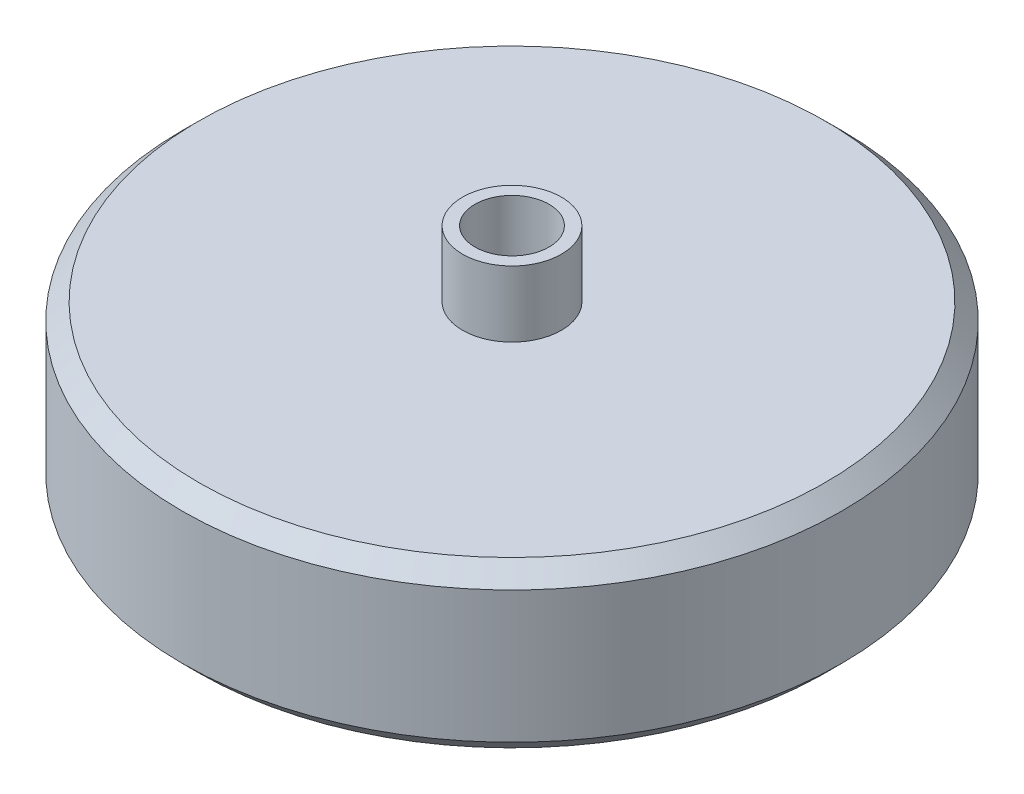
ISO-10303-21;
HEADER;
FILE_DESCRIPTION(('STEP AP214'),'2;1');
FILE_NAME('part.step','',(''),(''),'','','');
FILE_SCHEMA(('AUTOMOTIVE_DESIGN { 1 0 10303 214 1 1 1 1 }'));
ENDSEC;
DATA;
#1=APPLICATION_CONTEXT('core data for automotive mechanical design processes');
#2=APPLICATION_PROTOCOL_DEFINITION('international standard','automotive_design',2000,#1);
#3=PRODUCT_CONTEXT('',#1,'mechanical');
#4=PRODUCT('Part','Part','',(#3));
#5=PRODUCT_RELATED_PRODUCT_CATEGORY('part','',(#4));
#6=PRODUCT_DEFINITION_FORMATION('','',#4);
#7=PRODUCT_DEFINITION_CONTEXT('part definition',#1,'design');
#8=PRODUCT_DEFINITION('design','',#6,#7);
#9=PRODUCT_DEFINITION_SHAPE('','',#8);
#10=(LENGTH_UNIT() NAMED_UNIT(*) SI_UNIT(.MILLI.,.METRE.));
#11=(NAMED_UNIT(*) PLANE_ANGLE_UNIT() SI_UNIT($,.RADIAN.));
#12=(NAMED_UNIT(*) SI_UNIT($,.STERADIAN.) SOLID_ANGLE_UNIT());
#13=UNCERTAINTY_MEASURE_WITH_UNIT(LENGTH_MEASURE(1.E-05),#10,'distance_accuracy_value','');
#14=(GEOMETRIC_REPRESENTATION_CONTEXT(3) GLOBAL_UNCERTAINTY_ASSIGNED_CONTEXT((#13)) GLOBAL_UNIT_ASSIGNED_CONTEXT((#10,
#11,#12)) REPRESENTATION_CONTEXT('',''));
#15=CARTESIAN_POINT('',(0.,0.,0.));
#16=DIRECTION('',(0.,0.,1.));
#17=DIRECTION('',(1.,0.,0.));
#18=AXIS2_PLACEMENT_3D('',#15,#16,#17);
#19=CARTESIAN_POINT('',(0.,0.,0.));
#20=DIRECTION('',(0.,1.,0.));
#21=DIRECTION('',(0.,0.,1.));
#22=AXIS2_PLACEMENT_3D('',#19,#20,#21);
#23=PLANE('',#22);
#24=CARTESIAN_POINT('',(0.,0.,0.));
#25=DIRECTION('',(0.,1.,0.));
#26=DIRECTION('',(0.,0.,1.));
#27=AXIS2_PLACEMENT_3D('',#24,#25,#26);
#28=CIRCLE('',#27,19.);
#29=CARTESIAN_POINT('',(0.,0.,19.));
#30=VERTEX_POINT('',#29);
#31=EDGE_CURVE('E36',#30,#30,#28,.F.);
#32=ORIENTED_EDGE('',*,*,#31,.T.);
#33=EDGE_LOOP('',(#32));
#34=FACE_BOUND('',#33,.T.);
#35=CARTESIAN_POINT('',(0.,0.,0.));
#36=DIRECTION('',(0.,1.,0.));
#37=DIRECTION('',(0.,0.,1.));
#38=AXIS2_PLACEMENT_3D('',#35,#36,#37);
#39=CIRCLE('',#38,3.);
#40=CARTESIAN_POINT('',(0.,0.,3.));
#41=VERTEX_POINT('',#40);
#42=EDGE_CURVE('E49',#41,#41,#39,.F.);
#43=ORIENTED_EDGE('',*,*,#42,.F.);
#44=EDGE_LOOP('',(#43));
#45=FACE_BOUND('',#44,.T.);
#46=ADVANCED_FACE('F29',(#34,#45),#23,.F.);
#47=CARTESIAN_POINT('',(0.,10.,0.));
#48=DIRECTION('',(0.,1.,0.));
#49=DIRECTION('',(0.,0.,1.));
#50=AXIS2_PLACEMENT_3D('',#47,#48,#49);
#51=PLANE('',#50);
#52=CARTESIAN_POINT('',(0.,10.,0.));
#53=DIRECTION('',(0.,1.,0.));
#54=DIRECTION('',(0.,0.,1.));
#55=AXIS2_PLACEMENT_3D('',#52,#53,#54);
#56=CIRCLE('',#55,19.);
#57=CARTESIAN_POINT('',(0.,10.,19.));
#58=VERTEX_POINT('',#57);
#59=EDGE_CURVE('E10',#58,#58,#56,.T.);
#60=ORIENTED_EDGE('',*,*,#59,.T.);
#61=EDGE_LOOP('',(#60));
#62=FACE_BOUND('',#61,.T.);
#63=CARTESIAN_POINT('',(0.,10.,0.));
#64=DIRECTION('',(0.,1.,0.));
#65=DIRECTION('',(0.,0.,1.));
#66=AXIS2_PLACEMENT_3D('',#63,#64,#65);
#67=CIRCLE('',#66,3.);
#68=CARTESIAN_POINT('',(0.,10.,3.));
#69=VERTEX_POINT('',#68);
#70=EDGE_CURVE('E53',#69,#69,#67,.T.);
#71=ORIENTED_EDGE('',*,*,#70,.F.);
#72=EDGE_LOOP('',(#71));
#73=FACE_BOUND('',#72,.T.);
#74=ADVANCED_FACE('F92',(#62,#73),#51,.T.);
#75=CARTESIAN_POINT('',(0.,10.,0.));
#76=DIRECTION('',(0.,-1.,0.));
#77=DIRECTION('',(0.,0.,-1.));
#78=AXIS2_PLACEMENT_3D('',#75,#76,#77);
#79=CYLINDRICAL_SURFACE('',#78,20.);
#80=CARTESIAN_POINT('',(0.,1.,0.));
#81=DIRECTION('',(0.,1.,0.));
#82=DIRECTION('',(0.,0.,1.));
#83=AXIS2_PLACEMENT_3D('',#80,#81,#82);
#84=CIRCLE('',#83,20.);
#85=CARTESIAN_POINT('',(0.,1.,20.));
#86=VERTEX_POINT('',#85);
#87=EDGE_CURVE('E40',#86,#86,#84,.T.);
#88=ORIENTED_EDGE('',*,*,#87,.T.);
#89=EDGE_LOOP('',(#88));
#90=FACE_BOUND('',#89,.T.);
#91=CARTESIAN_POINT('',(0.,8.99999999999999,0.));
#92=DIRECTION('',(0.,1.,0.));
#93=DIRECTION('',(0.,0.,1.));
#94=AXIS2_PLACEMENT_3D('',#91,#92,#93);
#95=CIRCLE('',#94,20.);
#96=CARTESIAN_POINT('',(0.,8.99999999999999,20.));
#97=VERTEX_POINT('',#96);
#98=EDGE_CURVE('E44',#97,#97,#95,.F.);
#99=ORIENTED_EDGE('',*,*,#98,.T.);
#100=EDGE_LOOP('',(#99));
#101=FACE_BOUND('',#100,.T.);
#102=ADVANCED_FACE('F88',(#90,#101),#79,.T.);
#103=CARTESIAN_POINT('',(0.,14.,0.));
#104=DIRECTION('',(0.,-1.,0.));
#105=DIRECTION('',(0.,0.,-1.));
#106=AXIS2_PLACEMENT_3D('',#103,#104,#105);
#107=CYLINDRICAL_SURFACE('',#106,3.);
#108=CARTESIAN_POINT('',(0.,14.,0.));
#109=DIRECTION('',(0.,1.,0.));
#110=DIRECTION('',(0.,0.,1.));
#111=AXIS2_PLACEMENT_3D('',#108,#109,#110);
#112=CIRCLE('',#111,3.);
#113=CARTESIAN_POINT('',(0.,14.,3.));
#114=VERTEX_POINT('',#113);
#115=EDGE_CURVE('E52',#114,#114,#112,.T.);
#116=ORIENTED_EDGE('',*,*,#115,.F.);
#117=EDGE_LOOP('',(#116));
#118=FACE_BOUND('',#117,.T.);
#119=ORIENTED_EDGE('',*,*,#70,.T.);
#120=EDGE_LOOP('',(#119));
#121=FACE_BOUND('',#120,.T.);
#122=ADVANCED_FACE('F82',(#118,#121),#107,.T.);
#123=CARTESIAN_POINT('',(0.,14.,0.));
#124=DIRECTION('',(0.,1.,0.));
#125=DIRECTION('',(0.,0.,1.));
#126=AXIS2_PLACEMENT_3D('',#123,#124,#125);
#127=PLANE('',#126);
#128=CARTESIAN_POINT('',(0.,14.,0.));
#129=DIRECTION('',(0.,1.,0.));
#130=DIRECTION('',(0.,0.,1.));
#131=AXIS2_PLACEMENT_3D('',#128,#129,#130);
#132=CIRCLE('',#131,2.25);
#133=CARTESIAN_POINT('',(0.,14.,2.25));
#134=VERTEX_POINT('',#133);
#135=EDGE_CURVE('E62',#134,#134,#132,.T.);
#136=ORIENTED_EDGE('',*,*,#135,.F.);
#137=EDGE_LOOP('',(#136));
#138=FACE_BOUND('',#137,.T.);
#139=ORIENTED_EDGE('',*,*,#115,.T.);
#140=EDGE_LOOP('',(#139));
#141=FACE_BOUND('',#140,.T.);
#142=ADVANCED_FACE('F78',(#138,#141),#127,.T.);
#143=CARTESIAN_POINT('',(0.,-4.,0.));
#144=DIRECTION('',(0.,1.,0.));
#145=DIRECTION('',(0.,0.,1.));
#146=AXIS2_PLACEMENT_3D('',#143,#144,#145);
#147=CYLINDRICAL_SURFACE('',#146,3.);
#148=CARTESIAN_POINT('',(0.,-4.,0.));
#149=DIRECTION('',(0.,-1.,0.));
#150=DIRECTION('',(0.,0.,-1.));
#151=AXIS2_PLACEMENT_3D('',#148,#149,#150);
#152=CIRCLE('',#151,3.);
#153=CARTESIAN_POINT('',(0.,-4.,-3.));
#154=VERTEX_POINT('',#153);
#155=EDGE_CURVE('E56',#154,#154,#152,.T.);
#156=ORIENTED_EDGE('',*,*,#155,.F.);
#157=EDGE_LOOP('',(#156));
#158=FACE_BOUND('',#157,.T.);
#159=ORIENTED_EDGE('',*,*,#42,.T.);
#160=EDGE_LOOP('',(#159));
#161=FACE_BOUND('',#160,.T.);
#162=ADVANCED_FACE('F81',(#158,#161),#147,.T.);
#163=CARTESIAN_POINT('',(0.,-4.,0.));
#164=DIRECTION('',(0.,-1.,0.));
#165=DIRECTION('',(0.,0.,-1.));
#166=AXIS2_PLACEMENT_3D('',#163,#164,#165);
#167=PLANE('',#166);
#168=CARTESIAN_POINT('',(0.,-4.,0.));
#169=DIRECTION('',(0.,1.,0.));
#170=DIRECTION('',(0.,0.,1.));
#171=AXIS2_PLACEMENT_3D('',#168,#169,#170);
#172=CIRCLE('',#171,2.25);
#173=CARTESIAN_POINT('',(0.,-4.,2.25));
#174=VERTEX_POINT('',#173);
#175=EDGE_CURVE('E61',#174,#174,#172,.T.);
#176=ORIENTED_EDGE('',*,*,#175,.T.);
#177=EDGE_LOOP('',(#176));
#178=FACE_BOUND('',#177,.T.);
#179=ORIENTED_EDGE('',*,*,#155,.T.);
#180=EDGE_LOOP('',(#179));
#181=FACE_BOUND('',#180,.T.);
#182=ADVANCED_FACE('F68',(#178,#181),#167,.T.);
#183=CARTESIAN_POINT('',(0.,-4.,0.));
#184=DIRECTION('',(0.,1.,0.));
#185=DIRECTION('',(0.,0.,1.));
#186=AXIS2_PLACEMENT_3D('',#183,#184,#185);
#187=CYLINDRICAL_SURFACE('',#186,2.25);
#188=ORIENTED_EDGE('',*,*,#175,.F.);
#189=EDGE_LOOP('',(#188));
#190=FACE_BOUND('',#189,.T.);
#191=ORIENTED_EDGE('',*,*,#135,.T.);
#192=EDGE_LOOP('',(#191));
#193=FACE_BOUND('',#192,.T.);
#194=ADVANCED_FACE('F71',(#190,#193),#187,.F.);
#195=CARTESIAN_POINT('',(0.,1.,0.));
#196=DIRECTION('',(0.,1.,0.));
#197=DIRECTION('',(0.,0.,1.));
#198=AXIS2_PLACEMENT_3D('',#195,#196,#197);
#199=CONICAL_SURFACE('',#198,20.,0.78539816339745);
#200=ORIENTED_EDGE('',*,*,#31,.F.);
#201=EDGE_LOOP('',(#200));
#202=FACE_BOUND('',#201,.T.);
#203=ORIENTED_EDGE('',*,*,#87,.F.);
#204=EDGE_LOOP('',(#203));
#205=FACE_BOUND('',#204,.T.);
#206=ADVANCED_FACE('F74',(#202,#205),#199,.T.);
#207=CARTESIAN_POINT('',(0.,10.,0.));
#208=DIRECTION('',(0.,-1.,0.));
#209=DIRECTION('',(0.,0.,-1.));
#210=AXIS2_PLACEMENT_3D('',#207,#208,#209);
#211=CONICAL_SURFACE('',#210,19.,0.785398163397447);
#212=ORIENTED_EDGE('',*,*,#98,.F.);
#213=EDGE_LOOP('',(#212));
#214=FACE_BOUND('',#213,.T.);
#215=ORIENTED_EDGE('',*,*,#59,.F.);
#216=EDGE_LOOP('',(#215));
#217=FACE_BOUND('',#216,.T.);
#218=ADVANCED_FACE('F31',(#214,#217),#211,.T.);
#219=CLOSED_SHELL('',(#46,#74,#102,#122,#142,#162,#182,#194,#206,#218));
#220=MANIFOLD_SOLID_BREP('B2',#219);
#221=ADVANCED_BREP_SHAPE_REPRESENTATION('',(#18,#220),#14);
#222=SHAPE_DEFINITION_REPRESENTATION(#9,#221);
ENDSEC;
END-ISO-10303-21;
